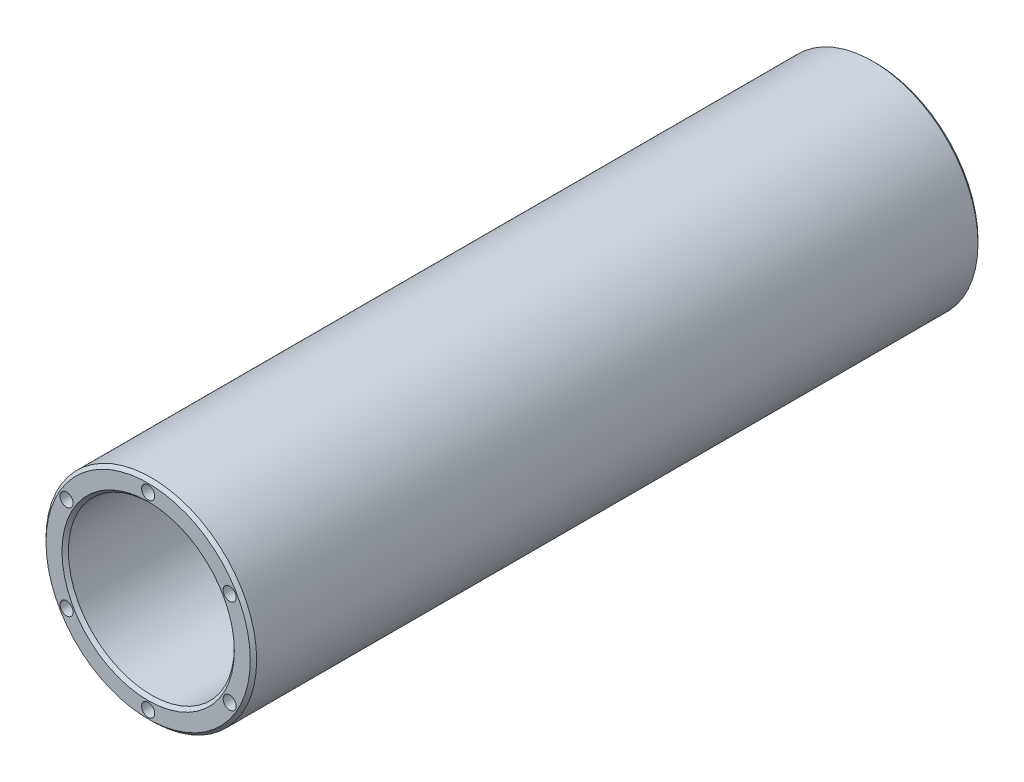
ISO-10303-21;
HEADER;
FILE_DESCRIPTION(('STEP AP214'),'2;1');
FILE_NAME('part.step','',(''),(''),'','','');
FILE_SCHEMA(('AUTOMOTIVE_DESIGN { 1 0 10303 214 1 1 1 1 }'));
ENDSEC;
DATA;
#1=APPLICATION_CONTEXT('core data for automotive mechanical design processes');
#2=APPLICATION_PROTOCOL_DEFINITION('international standard','automotive_design',2000,#1);
#3=PRODUCT_CONTEXT('',#1,'mechanical');
#4=PRODUCT('Part','Part','',(#3));
#5=PRODUCT_RELATED_PRODUCT_CATEGORY('part','',(#4));
#6=PRODUCT_DEFINITION_FORMATION('','',#4);
#7=PRODUCT_DEFINITION_CONTEXT('part definition',#1,'design');
#8=PRODUCT_DEFINITION('design','',#6,#7);
#9=PRODUCT_DEFINITION_SHAPE('','',#8);
#10=(LENGTH_UNIT() NAMED_UNIT(*) SI_UNIT(.MILLI.,.METRE.));
#11=(NAMED_UNIT(*) PLANE_ANGLE_UNIT() SI_UNIT($,.RADIAN.));
#12=(NAMED_UNIT(*) SI_UNIT($,.STERADIAN.) SOLID_ANGLE_UNIT());
#13=UNCERTAINTY_MEASURE_WITH_UNIT(LENGTH_MEASURE(1.E-05),#10,'distance_accuracy_value','');
#14=(GEOMETRIC_REPRESENTATION_CONTEXT(3) GLOBAL_UNCERTAINTY_ASSIGNED_CONTEXT((#13)) GLOBAL_UNIT_ASSIGNED_CONTEXT((#10,
#11,#12)) REPRESENTATION_CONTEXT('',''));
#15=CARTESIAN_POINT('',(0.,0.,0.));
#16=DIRECTION('',(0.,0.,1.));
#17=DIRECTION('',(1.,0.,0.));
#18=AXIS2_PLACEMENT_3D('',#15,#16,#17);
#19=CARTESIAN_POINT('',(0.,0.,57.));
#20=DIRECTION('',(0.,0.,1.));
#21=DIRECTION('',(1.,0.,0.));
#22=AXIS2_PLACEMENT_3D('',#19,#20,#21);
#23=PLANE('',#22);
#24=CARTESIAN_POINT('',(0.,0.,57.));
#25=DIRECTION('',(0.,0.,1.));
#26=DIRECTION('',(1.,0.,0.));
#27=AXIS2_PLACEMENT_3D('',#24,#25,#26);
#28=CIRCLE('',#27,13.5000000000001);
#29=CARTESIAN_POINT('',(13.5000000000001,0.,57.));
#30=VERTEX_POINT('',#29);
#31=EDGE_CURVE('E217',#30,#30,#28,.F.);
#32=ORIENTED_EDGE('',*,*,#31,.T.);
#33=EDGE_LOOP('',(#32));
#34=FACE_BOUND('',#33,.T.);
#35=CARTESIAN_POINT('',(0.,0.,57.));
#36=DIRECTION('',(0.,0.,1.));
#37=DIRECTION('',(1.,0.,0.));
#38=AXIS2_PLACEMENT_3D('',#35,#36,#37);
#39=CIRCLE('',#38,16.0000000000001);
#40=CARTESIAN_POINT('',(16.0000000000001,0.,57.));
#41=VERTEX_POINT('',#40);
#42=EDGE_CURVE('E213',#41,#41,#39,.T.);
#43=ORIENTED_EDGE('',*,*,#42,.T.);
#44=EDGE_LOOP('',(#43));
#45=FACE_BOUND('',#44,.T.);
#46=CARTESIAN_POINT('',(12.7738747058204,7.37500000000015,57.));
#47=DIRECTION('',(0.,0.,1.));
#48=DIRECTION('',(1.,0.,0.));
#49=AXIS2_PLACEMENT_3D('',#46,#47,#48);
#50=CIRCLE('',#49,1.025);
#51=CARTESIAN_POINT('',(13.7988747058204,7.37500000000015,57.));
#52=VERTEX_POINT('',#51);
#53=EDGE_CURVE('E103',#52,#52,#50,.T.);
#54=ORIENTED_EDGE('',*,*,#53,.F.);
#55=EDGE_LOOP('',(#54));
#56=FACE_BOUND('',#55,.T.);
#57=CARTESIAN_POINT('',(12.7738747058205,-7.37499999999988,57.));
#58=DIRECTION('',(0.,0.,1.));
#59=DIRECTION('',(1.,0.,0.));
#60=AXIS2_PLACEMENT_3D('',#57,#58,#59);
#61=CIRCLE('',#60,1.025);
#62=CARTESIAN_POINT('',(13.7988747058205,-7.37499999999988,57.));
#63=VERTEX_POINT('',#62);
#64=EDGE_CURVE('E102',#63,#63,#61,.T.);
#65=ORIENTED_EDGE('',*,*,#64,.F.);
#66=EDGE_LOOP('',(#65));
#67=FACE_BOUND('',#66,.T.);
#68=CARTESIAN_POINT('',(0.,-14.75,57.));
#69=DIRECTION('',(0.,0.,1.));
#70=DIRECTION('',(1.,0.,0.));
#71=AXIS2_PLACEMENT_3D('',#68,#69,#70);
#72=CIRCLE('',#71,1.025);
#73=CARTESIAN_POINT('',(1.025,-14.75,57.));
#74=VERTEX_POINT('',#73);
#75=EDGE_CURVE('E117',#74,#74,#72,.T.);
#76=ORIENTED_EDGE('',*,*,#75,.F.);
#77=EDGE_LOOP('',(#76));
#78=FACE_BOUND('',#77,.T.);
#79=CARTESIAN_POINT('',(-12.7738747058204,-7.37500000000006,57.));
#80=DIRECTION('',(0.,0.,1.));
#81=DIRECTION('',(1.,0.,0.));
#82=AXIS2_PLACEMENT_3D('',#79,#80,#81);
#83=CIRCLE('',#82,1.025);
#84=CARTESIAN_POINT('',(-11.7488747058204,-7.37500000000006,57.));
#85=VERTEX_POINT('',#84);
#86=EDGE_CURVE('E125',#85,#85,#83,.T.);
#87=ORIENTED_EDGE('',*,*,#86,.F.);
#88=EDGE_LOOP('',(#87));
#89=FACE_BOUND('',#88,.T.);
#90=CARTESIAN_POINT('',(-12.7738747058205,7.37499999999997,57.));
#91=DIRECTION('',(0.,0.,1.));
#92=DIRECTION('',(1.,0.,0.));
#93=AXIS2_PLACEMENT_3D('',#90,#91,#92);
#94=CIRCLE('',#93,1.025);
#95=CARTESIAN_POINT('',(-11.7488747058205,7.37499999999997,57.));
#96=VERTEX_POINT('',#95);
#97=EDGE_CURVE('E133',#96,#96,#94,.T.);
#98=ORIENTED_EDGE('',*,*,#97,.F.);
#99=EDGE_LOOP('',(#98));
#100=FACE_BOUND('',#99,.T.);
#101=CARTESIAN_POINT('',(0.,14.75,57.));
#102=DIRECTION('',(0.,0.,1.));
#103=DIRECTION('',(1.,0.,0.));
#104=AXIS2_PLACEMENT_3D('',#101,#102,#103);
#105=CIRCLE('',#104,1.025);
#106=CARTESIAN_POINT('',(1.025,14.75,57.));
#107=VERTEX_POINT('',#106);
#108=EDGE_CURVE('E141',#107,#107,#105,.T.);
#109=ORIENTED_EDGE('',*,*,#108,.F.);
#110=EDGE_LOOP('',(#109));
#111=FACE_BOUND('',#110,.T.);
#112=ADVANCED_FACE('F44',(#34,#45,#56,#67,#78,#89,#100,#111),#23,.T.);
#113=CARTESIAN_POINT('',(0.,0.,-57.));
#114=DIRECTION('',(0.,0.,1.));
#115=DIRECTION('',(1.,0.,0.));
#116=AXIS2_PLACEMENT_3D('',#113,#114,#115);
#117=PLANE('',#116);
#118=CARTESIAN_POINT('',(0.,0.,-57.));
#119=DIRECTION('',(0.,0.,1.));
#120=DIRECTION('',(1.,0.,0.));
#121=AXIS2_PLACEMENT_3D('',#118,#119,#120);
#122=CIRCLE('',#121,13.5);
#123=CARTESIAN_POINT('',(13.5,0.,-57.));
#124=VERTEX_POINT('',#123);
#125=EDGE_CURVE('E201',#124,#124,#122,.T.);
#126=ORIENTED_EDGE('',*,*,#125,.T.);
#127=EDGE_LOOP('',(#126));
#128=FACE_BOUND('',#127,.T.);
#129=CARTESIAN_POINT('',(0.,0.,-57.));
#130=DIRECTION('',(0.,0.,1.));
#131=DIRECTION('',(1.,0.,0.));
#132=AXIS2_PLACEMENT_3D('',#129,#130,#131);
#133=CIRCLE('',#132,15.9999999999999);
#134=CARTESIAN_POINT('',(15.9999999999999,0.,-57.));
#135=VERTEX_POINT('',#134);
#136=EDGE_CURVE('E197',#135,#135,#133,.F.);
#137=ORIENTED_EDGE('',*,*,#136,.T.);
#138=EDGE_LOOP('',(#137));
#139=FACE_BOUND('',#138,.T.);
#140=CARTESIAN_POINT('',(12.7738747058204,7.37500000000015,-57.));
#141=DIRECTION('',(0.,0.,-1.));
#142=DIRECTION('',(-1.,0.,0.));
#143=AXIS2_PLACEMENT_3D('',#140,#141,#142);
#144=CIRCLE('',#143,1.025);
#145=CARTESIAN_POINT('',(11.7488747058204,7.37500000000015,-57.));
#146=VERTEX_POINT('',#145);
#147=EDGE_CURVE('E149',#146,#146,#144,.T.);
#148=ORIENTED_EDGE('',*,*,#147,.F.);
#149=EDGE_LOOP('',(#148));
#150=FACE_BOUND('',#149,.T.);
#151=CARTESIAN_POINT('',(12.7738747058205,-7.37499999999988,-57.));
#152=DIRECTION('',(0.,0.,-1.));
#153=DIRECTION('',(-1.,0.,0.));
#154=AXIS2_PLACEMENT_3D('',#151,#152,#153);
#155=CIRCLE('',#154,1.025);
#156=CARTESIAN_POINT('',(11.7488747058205,-7.37499999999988,-57.));
#157=VERTEX_POINT('',#156);
#158=EDGE_CURVE('E157',#157,#157,#155,.T.);
#159=ORIENTED_EDGE('',*,*,#158,.F.);
#160=EDGE_LOOP('',(#159));
#161=FACE_BOUND('',#160,.T.);
#162=CARTESIAN_POINT('',(0.,-14.75,-57.));
#163=DIRECTION('',(0.,0.,-1.));
#164=DIRECTION('',(-1.,0.,0.));
#165=AXIS2_PLACEMENT_3D('',#162,#163,#164);
#166=CIRCLE('',#165,1.025);
#167=CARTESIAN_POINT('',(-1.025,-14.75,-57.));
#168=VERTEX_POINT('',#167);
#169=EDGE_CURVE('E165',#168,#168,#166,.T.);
#170=ORIENTED_EDGE('',*,*,#169,.F.);
#171=EDGE_LOOP('',(#170));
#172=FACE_BOUND('',#171,.T.);
#173=CARTESIAN_POINT('',(-12.7738747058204,-7.37500000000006,-57.));
#174=DIRECTION('',(0.,0.,-1.));
#175=DIRECTION('',(-1.,0.,0.));
#176=AXIS2_PLACEMENT_3D('',#173,#174,#175);
#177=CIRCLE('',#176,1.025);
#178=CARTESIAN_POINT('',(-13.7988747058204,-7.37500000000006,-57.));
#179=VERTEX_POINT('',#178);
#180=EDGE_CURVE('E173',#179,#179,#177,.T.);
#181=ORIENTED_EDGE('',*,*,#180,.F.);
#182=EDGE_LOOP('',(#181));
#183=FACE_BOUND('',#182,.T.);
#184=CARTESIAN_POINT('',(-12.7738747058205,7.37499999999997,-57.));
#185=DIRECTION('',(0.,0.,-1.));
#186=DIRECTION('',(-1.,0.,0.));
#187=AXIS2_PLACEMENT_3D('',#184,#185,#186);
#188=CIRCLE('',#187,1.025);
#189=CARTESIAN_POINT('',(-13.7988747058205,7.37499999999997,-57.));
#190=VERTEX_POINT('',#189);
#191=EDGE_CURVE('E181',#190,#190,#188,.T.);
#192=ORIENTED_EDGE('',*,*,#191,.F.);
#193=EDGE_LOOP('',(#192));
#194=FACE_BOUND('',#193,.T.);
#195=CARTESIAN_POINT('',(0.,14.75,-57.));
#196=DIRECTION('',(0.,0.,-1.));
#197=DIRECTION('',(-1.,0.,0.));
#198=AXIS2_PLACEMENT_3D('',#195,#196,#197);
#199=CIRCLE('',#198,1.025);
#200=CARTESIAN_POINT('',(-1.025,14.75,-57.));
#201=VERTEX_POINT('',#200);
#202=EDGE_CURVE('E189',#201,#201,#199,.T.);
#203=ORIENTED_EDGE('',*,*,#202,.F.);
#204=EDGE_LOOP('',(#203));
#205=FACE_BOUND('',#204,.T.);
#206=ADVANCED_FACE('F234',(#128,#139,#150,#161,#172,#183,#194,#205),#117,.F.);
#207=CARTESIAN_POINT('',(0.,0.,57.));
#208=DIRECTION('',(0.,0.,-1.));
#209=DIRECTION('',(-1.,0.,0.));
#210=AXIS2_PLACEMENT_3D('',#207,#208,#209);
#211=CYLINDRICAL_SURFACE('',#210,16.5);
#212=CARTESIAN_POINT('',(0.,0.,-56.4999999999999));
#213=DIRECTION('',(0.,0.,1.));
#214=DIRECTION('',(1.,0.,0.));
#215=AXIS2_PLACEMENT_3D('',#212,#213,#214);
#216=CIRCLE('',#215,16.5);
#217=CARTESIAN_POINT('',(-16.5,0.,-56.4999999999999));
#218=VERTEX_POINT('',#217);
#219=EDGE_CURVE('E11',#218,#218,#216,.T.);
#220=CARTESIAN_POINT('',(0.,0.,56.5000000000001));
#221=DIRECTION('',(0.,0.,1.));
#222=DIRECTION('',(1.,0.,0.));
#223=AXIS2_PLACEMENT_3D('',#220,#221,#222);
#224=CIRCLE('',#223,16.5);
#225=CARTESIAN_POINT('',(-16.5,0.,56.5000000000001));
#226=VERTEX_POINT('',#225);
#227=EDGE_CURVE('E54',#226,#226,#224,.F.);
#228=CARTESIAN_POINT('',(-16.5,0.,-56.4999999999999));
#229=CARTESIAN_POINT('',(-16.5,0.,-55.3229166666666));
#230=CARTESIAN_POINT('',(-16.5,0.,-54.1458333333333));
#231=CARTESIAN_POINT('',(-16.5,0.,-51.7916666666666));
#232=CARTESIAN_POINT('',(-16.5,0.,-50.6145833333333));
#233=CARTESIAN_POINT('',(-16.5,0.,-48.2604166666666));
#234=CARTESIAN_POINT('',(-16.5,0.,-47.0833333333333));
#235=CARTESIAN_POINT('',(-16.5,0.,-44.7291666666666));
#236=CARTESIAN_POINT('',(-16.5,0.,-43.5520833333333));
#237=CARTESIAN_POINT('',(-16.5,0.,-41.1979166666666));
#238=CARTESIAN_POINT('',(-16.5,0.,-40.0208333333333));
#239=CARTESIAN_POINT('',(-16.5,0.,-37.6666666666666));
#240=CARTESIAN_POINT('',(-16.5,0.,-36.4895833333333));
#241=CARTESIAN_POINT('',(-16.5,0.,-34.1354166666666));
#242=CARTESIAN_POINT('',(-16.5,0.,-32.9583333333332));
#243=CARTESIAN_POINT('',(-16.5,0.,-30.6041666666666));
#244=CARTESIAN_POINT('',(-16.5,0.,-29.4270833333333));
#245=CARTESIAN_POINT('',(-16.5,0.,-27.0729166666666));
#246=CARTESIAN_POINT('',(-16.5,0.,-25.8958333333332));
#247=CARTESIAN_POINT('',(-16.5,0.,-23.5416666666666));
#248=CARTESIAN_POINT('',(-16.5,0.,-22.3645833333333));
#249=CARTESIAN_POINT('',(-16.5,0.,-20.0104166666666));
#250=CARTESIAN_POINT('',(-16.5,0.,-18.8333333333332));
#251=CARTESIAN_POINT('',(-16.5,0.,-16.4791666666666));
#252=CARTESIAN_POINT('',(-16.5,0.,-15.3020833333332));
#253=CARTESIAN_POINT('',(-16.5,0.,-12.9479166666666));
#254=CARTESIAN_POINT('',(-16.5,0.,-11.7708333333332));
#255=CARTESIAN_POINT('',(-16.5,0.,-9.41666666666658));
#256=CARTESIAN_POINT('',(-16.5,0.,-8.23958333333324));
#257=CARTESIAN_POINT('',(-16.5,0.,-5.88541666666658));
#258=CARTESIAN_POINT('',(-16.5,0.,-4.70833333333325));
#259=CARTESIAN_POINT('',(-16.5,0.,-2.35416666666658));
#260=CARTESIAN_POINT('',(-16.5,0.,-1.17708333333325));
#261=CARTESIAN_POINT('',(-16.5,0.,1.17708333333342));
#262=CARTESIAN_POINT('',(-16.5,0.,2.35416666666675));
#263=CARTESIAN_POINT('',(-16.5,0.,4.70833333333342));
#264=CARTESIAN_POINT('',(-16.5,0.,5.88541666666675));
#265=CARTESIAN_POINT('',(-16.5,0.,8.23958333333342));
#266=CARTESIAN_POINT('',(-16.5,0.,9.41666666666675));
#267=CARTESIAN_POINT('',(-16.5,0.,11.7708333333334));
#268=CARTESIAN_POINT('',(-16.5,0.,12.9479166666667));
#269=CARTESIAN_POINT('',(-16.5,0.,15.3020833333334));
#270=CARTESIAN_POINT('',(-16.5,0.,16.4791666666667));
#271=CARTESIAN_POINT('',(-16.5,0.,18.8333333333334));
#272=CARTESIAN_POINT('',(-16.5,0.,20.0104166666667));
#273=CARTESIAN_POINT('',(-16.5,0.,22.3645833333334));
#274=CARTESIAN_POINT('',(-16.5,0.,23.5416666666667));
#275=CARTESIAN_POINT('',(-16.5,0.,25.8958333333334));
#276=CARTESIAN_POINT('',(-16.5,0.,27.0729166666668));
#277=CARTESIAN_POINT('',(-16.5,0.,29.4270833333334));
#278=CARTESIAN_POINT('',(-16.5,0.,30.6041666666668));
#279=CARTESIAN_POINT('',(-16.5,0.,32.9583333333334));
#280=CARTESIAN_POINT('',(-16.5,0.,34.1354166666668));
#281=CARTESIAN_POINT('',(-16.5,0.,36.4895833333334));
#282=CARTESIAN_POINT('',(-16.5,0.,37.6666666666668));
#283=CARTESIAN_POINT('',(-16.5,0.,40.0208333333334));
#284=CARTESIAN_POINT('',(-16.5,0.,41.1979166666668));
#285=CARTESIAN_POINT('',(-16.5,0.,43.5520833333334));
#286=CARTESIAN_POINT('',(-16.5,0.,44.7291666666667));
#287=CARTESIAN_POINT('',(-16.5,0.,47.0833333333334));
#288=CARTESIAN_POINT('',(-16.5,0.,48.2604166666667));
#289=CARTESIAN_POINT('',(-16.5,0.,50.6145833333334));
#290=CARTESIAN_POINT('',(-16.5,0.,51.7916666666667));
#291=CARTESIAN_POINT('',(-16.5,0.,54.1458333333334));
#292=CARTESIAN_POINT('',(-16.5,0.,55.3229166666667));
#293=CARTESIAN_POINT('',(-16.5,0.,56.5000000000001));
#294=B_SPLINE_CURVE_WITH_KNOTS('',3,(#228,#229,#230,#231,#232,#233,#234,#235,#236,#237,#238,
#239,#240,#241,#242,#243,#244,#245,#246,#247,#248,#249,#250,#251,#252,#253,#254,#255,#256,#257,
#258,#259,#260,#261,#262,#263,#264,#265,#266,#267,#268,#269,#270,#271,#272,#273,#274,#275,#276,
#277,#278,#279,#280,#281,#282,#283,#284,#285,#286,#287,#288,#289,#290,#291,#292,#293),
.UNSPECIFIED.,.F.,.F.,(4,2,2,2,2,2,2,2,2,2,2,2,2,2,2,2,2,2,2,2,2,2,2,2,2,2,2,2,2,2,2,2,4),(0.,
3.53125,7.0625,10.59375,14.125,17.65625,21.1875,24.71875,28.25,31.78125,35.3125,38.84375,42.375,
45.90625,49.4375,52.96875,56.5,60.03125,63.5625,67.09375,70.625,74.15625,77.6875,81.21875,84.75,
88.28125,91.8125,95.34375,98.875,102.40625,105.9375,109.46875,113.),.UNSPECIFIED.);
#295=EDGE_CURVE('BSEAM225',#218,#226,#294,.T.);
#296=ORIENTED_EDGE('',*,*,#219,.T.);
#297=ORIENTED_EDGE('',*,*,#227,.T.);
#298=ORIENTED_EDGE('',*,*,#295,.T.);
#299=ORIENTED_EDGE('',*,*,#295,.F.);
#300=EDGE_LOOP('',(#296,#298,#297,#299));
#301=FACE_BOUND('',#300,.T.);
#302=ADVANCED_FACE('F225',(#301),#211,.T.);
#303=CARTESIAN_POINT('',(0.,0.,57.));
#304=DIRECTION('',(0.,0.,-1.));
#305=DIRECTION('',(-1.,0.,0.));
#306=AXIS2_PLACEMENT_3D('',#303,#304,#305);
#307=CYLINDRICAL_SURFACE('',#306,13.);
#308=CARTESIAN_POINT('',(0.,0.,-56.5));
#309=DIRECTION('',(0.,0.,1.));
#310=DIRECTION('',(1.,0.,0.));
#311=AXIS2_PLACEMENT_3D('',#308,#309,#310);
#312=CIRCLE('',#311,13.);
#313=CARTESIAN_POINT('',(-13.,0.,-56.5));
#314=VERTEX_POINT('',#313);
#315=EDGE_CURVE('E209',#314,#314,#312,.F.);
#316=CARTESIAN_POINT('',(0.,0.,56.4999999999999));
#317=DIRECTION('',(0.,0.,1.));
#318=DIRECTION('',(1.,0.,0.));
#319=AXIS2_PLACEMENT_3D('',#316,#317,#318);
#320=CIRCLE('',#319,13.);
#321=CARTESIAN_POINT('',(-13.,0.,56.4999999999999));
#322=VERTEX_POINT('',#321);
#323=EDGE_CURVE('E205',#322,#322,#320,.T.);
#324=CARTESIAN_POINT('',(-13.,0.,-56.5));
#325=CARTESIAN_POINT('',(-13.,0.,-55.3229166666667));
#326=CARTESIAN_POINT('',(-13.,0.,-54.1458333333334));
#327=CARTESIAN_POINT('',(-13.,0.,-51.7916666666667));
#328=CARTESIAN_POINT('',(-13.,0.,-50.6145833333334));
#329=CARTESIAN_POINT('',(-13.,0.,-48.2604166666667));
#330=CARTESIAN_POINT('',(-13.,0.,-47.0833333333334));
#331=CARTESIAN_POINT('',(-13.,0.,-44.7291666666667));
#332=CARTESIAN_POINT('',(-13.,0.,-43.5520833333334));
#333=CARTESIAN_POINT('',(-13.,0.,-41.1979166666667));
#334=CARTESIAN_POINT('',(-13.,0.,-40.0208333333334));
#335=CARTESIAN_POINT('',(-13.,0.,-37.6666666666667));
#336=CARTESIAN_POINT('',(-13.,0.,-36.4895833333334));
#337=CARTESIAN_POINT('',(-13.,0.,-34.1354166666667));
#338=CARTESIAN_POINT('',(-13.,0.,-32.9583333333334));
#339=CARTESIAN_POINT('',(-13.,0.,-30.6041666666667));
#340=CARTESIAN_POINT('',(-13.,0.,-29.4270833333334));
#341=CARTESIAN_POINT('',(-13.,0.,-27.0729166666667));
#342=CARTESIAN_POINT('',(-13.,0.,-25.8958333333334));
#343=CARTESIAN_POINT('',(-13.,0.,-23.5416666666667));
#344=CARTESIAN_POINT('',(-13.,0.,-22.3645833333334));
#345=CARTESIAN_POINT('',(-13.,0.,-20.0104166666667));
#346=CARTESIAN_POINT('',(-13.,0.,-18.8333333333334));
#347=CARTESIAN_POINT('',(-13.,0.,-16.4791666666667));
#348=CARTESIAN_POINT('',(-13.,0.,-15.3020833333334));
#349=CARTESIAN_POINT('',(-13.,0.,-12.9479166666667));
#350=CARTESIAN_POINT('',(-13.,0.,-11.7708333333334));
#351=CARTESIAN_POINT('',(-13.,0.,-9.41666666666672));
#352=CARTESIAN_POINT('',(-13.,0.,-8.23958333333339));
#353=CARTESIAN_POINT('',(-13.,0.,-5.88541666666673));
#354=CARTESIAN_POINT('',(-13.,0.,-4.7083333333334));
#355=CARTESIAN_POINT('',(-13.,0.,-2.35416666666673));
#356=CARTESIAN_POINT('',(-13.,0.,-1.1770833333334));
#357=CARTESIAN_POINT('',(-13.,0.,1.17708333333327));
#358=CARTESIAN_POINT('',(-13.,0.,2.3541666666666));
#359=CARTESIAN_POINT('',(-13.,0.,4.70833333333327));
#360=CARTESIAN_POINT('',(-13.,0.,5.8854166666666));
#361=CARTESIAN_POINT('',(-13.,0.,8.23958333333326));
#362=CARTESIAN_POINT('',(-13.,0.,9.4166666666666));
#363=CARTESIAN_POINT('',(-13.,0.,11.7708333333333));
#364=CARTESIAN_POINT('',(-13.,0.,12.9479166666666));
#365=CARTESIAN_POINT('',(-13.,0.,15.3020833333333));
#366=CARTESIAN_POINT('',(-13.,0.,16.4791666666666));
#367=CARTESIAN_POINT('',(-13.,0.,18.8333333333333));
#368=CARTESIAN_POINT('',(-13.,0.,20.0104166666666));
#369=CARTESIAN_POINT('',(-13.,0.,22.3645833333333));
#370=CARTESIAN_POINT('',(-13.,0.,23.5416666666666));
#371=CARTESIAN_POINT('',(-13.,0.,25.8958333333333));
#372=CARTESIAN_POINT('',(-13.,0.,27.0729166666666));
#373=CARTESIAN_POINT('',(-13.,0.,29.4270833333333));
#374=CARTESIAN_POINT('',(-13.,0.,30.6041666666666));
#375=CARTESIAN_POINT('',(-13.,0.,32.9583333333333));
#376=CARTESIAN_POINT('',(-13.,0.,34.1354166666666));
#377=CARTESIAN_POINT('',(-13.,0.,36.4895833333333));
#378=CARTESIAN_POINT('',(-13.,0.,37.6666666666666));
#379=CARTESIAN_POINT('',(-13.,0.,40.0208333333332));
#380=CARTESIAN_POINT('',(-13.,0.,41.1979166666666));
#381=CARTESIAN_POINT('',(-13.,0.,43.5520833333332));
#382=CARTESIAN_POINT('',(-13.,0.,44.7291666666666));
#383=CARTESIAN_POINT('',(-13.,0.,47.0833333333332));
#384=CARTESIAN_POINT('',(-13.,0.,48.2604166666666));
#385=CARTESIAN_POINT('',(-13.,0.,50.6145833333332));
#386=CARTESIAN_POINT('',(-13.,0.,51.7916666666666));
#387=CARTESIAN_POINT('',(-13.,0.,54.1458333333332));
#388=CARTESIAN_POINT('',(-13.,0.,55.3229166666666));
#389=CARTESIAN_POINT('',(-13.,0.,56.4999999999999));
#390=B_SPLINE_CURVE_WITH_KNOTS('',3,(#324,#325,#326,#327,#328,#329,#330,#331,#332,#333,#334,
#335,#336,#337,#338,#339,#340,#341,#342,#343,#344,#345,#346,#347,#348,#349,#350,#351,#352,#353,
#354,#355,#356,#357,#358,#359,#360,#361,#362,#363,#364,#365,#366,#367,#368,#369,#370,#371,#372,
#373,#374,#375,#376,#377,#378,#379,#380,#381,#382,#383,#384,#385,#386,#387,#388,#389),
.UNSPECIFIED.,.F.,.F.,(4,2,2,2,2,2,2,2,2,2,2,2,2,2,2,2,2,2,2,2,2,2,2,2,2,2,2,2,2,2,2,2,4),(0.,
3.53125,7.0625,10.59375,14.125,17.65625,21.1875,24.71875,28.25,31.78125,35.3125,38.84375,42.375,
45.90625,49.4375,52.96875,56.5,60.03125,63.5625,67.09375,70.625,74.15625,77.6875,81.21875,84.75,
88.28125,91.8125,95.3437499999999,98.8749999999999,102.40625,105.9375,109.46875,113.),.UNSPECIFIED.);
#391=EDGE_CURVE('BSEAM313',#314,#322,#390,.T.);
#392=ORIENTED_EDGE('',*,*,#315,.T.);
#393=ORIENTED_EDGE('',*,*,#323,.T.);
#394=ORIENTED_EDGE('',*,*,#391,.T.);
#395=ORIENTED_EDGE('',*,*,#391,.F.);
#396=EDGE_LOOP('',(#392,#394,#393,#395));
#397=FACE_BOUND('',#396,.T.);
#398=ADVANCED_FACE('F313',(#397),#307,.F.);
#399=CARTESIAN_POINT('',(0.,14.75,-45.));
#400=DIRECTION('',(0.,0.,-1.));
#401=DIRECTION('',(-1.,0.,0.));
#402=AXIS2_PLACEMENT_3D('',#399,#400,#401);
#403=CONICAL_SURFACE('',#402,1.025,1.02974425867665);
#404=CARTESIAN_POINT('',(0.,14.75,-44.3841178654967));
#405=VERTEX_POINT('',#404);
#406=VERTEX_LOOP('',#405);
#407=FACE_BOUND('',#406,.T.);
#408=CARTESIAN_POINT('',(0.,14.75,-45.));
#409=DIRECTION('',(0.,0.,-1.));
#410=DIRECTION('',(-1.,0.,0.));
#411=AXIS2_PLACEMENT_3D('',#408,#409,#410);
#412=CIRCLE('',#411,1.025);
#413=CARTESIAN_POINT('',(-1.025,14.75,-45.));
#414=VERTEX_POINT('',#413);
#415=EDGE_CURVE('E193',#414,#414,#412,.T.);
#416=ORIENTED_EDGE('',*,*,#415,.T.);
#417=EDGE_LOOP('',(#416));
#418=FACE_BOUND('',#417,.T.);
#419=ADVANCED_FACE('F309',(#407,#418),#403,.F.);
#420=CARTESIAN_POINT('',(0.,14.75,-57.));
#421=DIRECTION('',(0.,0.,-1.));
#422=DIRECTION('',(-1.,0.,0.));
#423=AXIS2_PLACEMENT_3D('',#420,#421,#422);
#424=CYLINDRICAL_SURFACE('',#423,1.025);
#425=ORIENTED_EDGE('',*,*,#415,.F.);
#426=EDGE_LOOP('',(#425));
#427=FACE_BOUND('',#426,.T.);
#428=ORIENTED_EDGE('',*,*,#202,.T.);
#429=EDGE_LOOP('',(#428));
#430=FACE_BOUND('',#429,.T.);
#431=ADVANCED_FACE('F306',(#427,#430),#424,.F.);
#432=CARTESIAN_POINT('',(-12.7738747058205,7.37499999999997,-45.));
#433=DIRECTION('',(0.,0.,-1.));
#434=DIRECTION('',(-1.,0.,0.));
#435=AXIS2_PLACEMENT_3D('',#432,#433,#434);
#436=CONICAL_SURFACE('',#435,1.025,1.02974425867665);
#437=CARTESIAN_POINT('',(-12.7738747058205,7.37499999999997,-44.3841178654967));
#438=VERTEX_POINT('',#437);
#439=VERTEX_LOOP('',#438);
#440=FACE_BOUND('',#439,.T.);
#441=CARTESIAN_POINT('',(-12.7738747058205,7.37499999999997,-45.));
#442=DIRECTION('',(0.,0.,-1.));
#443=DIRECTION('',(-1.,0.,0.));
#444=AXIS2_PLACEMENT_3D('',#441,#442,#443);
#445=CIRCLE('',#444,1.025);
#446=CARTESIAN_POINT('',(-13.7988747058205,7.37499999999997,-45.));
#447=VERTEX_POINT('',#446);
#448=EDGE_CURVE('E185',#447,#447,#445,.T.);
#449=ORIENTED_EDGE('',*,*,#448,.T.);
#450=EDGE_LOOP('',(#449));
#451=FACE_BOUND('',#450,.T.);
#452=ADVANCED_FACE('F302',(#440,#451),#436,.F.);
#453=CARTESIAN_POINT('',(-12.7738747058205,7.37499999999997,-57.));
#454=DIRECTION('',(0.,0.,-1.));
#455=DIRECTION('',(-1.,0.,0.));
#456=AXIS2_PLACEMENT_3D('',#453,#454,#455);
#457=CYLINDRICAL_SURFACE('',#456,1.025);
#458=ORIENTED_EDGE('',*,*,#448,.F.);
#459=EDGE_LOOP('',(#458));
#460=FACE_BOUND('',#459,.T.);
#461=ORIENTED_EDGE('',*,*,#191,.T.);
#462=EDGE_LOOP('',(#461));
#463=FACE_BOUND('',#462,.T.);
#464=ADVANCED_FACE('F298',(#460,#463),#457,.F.);
#465=CARTESIAN_POINT('',(-12.7738747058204,-7.37500000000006,-45.));
#466=DIRECTION('',(0.,0.,-1.));
#467=DIRECTION('',(-1.,0.,0.));
#468=AXIS2_PLACEMENT_3D('',#465,#466,#467);
#469=CONICAL_SURFACE('',#468,1.025,1.02974425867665);
#470=CARTESIAN_POINT('',(-12.7738747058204,-7.37500000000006,-44.3841178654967));
#471=VERTEX_POINT('',#470);
#472=VERTEX_LOOP('',#471);
#473=FACE_BOUND('',#472,.T.);
#474=CARTESIAN_POINT('',(-12.7738747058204,-7.37500000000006,-45.));
#475=DIRECTION('',(0.,0.,-1.));
#476=DIRECTION('',(-1.,0.,0.));
#477=AXIS2_PLACEMENT_3D('',#474,#475,#476);
#478=CIRCLE('',#477,1.025);
#479=CARTESIAN_POINT('',(-13.7988747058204,-7.37500000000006,-45.));
#480=VERTEX_POINT('',#479);
#481=EDGE_CURVE('E177',#480,#480,#478,.T.);
#482=ORIENTED_EDGE('',*,*,#481,.T.);
#483=EDGE_LOOP('',(#482));
#484=FACE_BOUND('',#483,.T.);
#485=ADVANCED_FACE('F294',(#473,#484),#469,.F.);
#486=CARTESIAN_POINT('',(-12.7738747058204,-7.37500000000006,-57.));
#487=DIRECTION('',(0.,0.,-1.));
#488=DIRECTION('',(-1.,0.,0.));
#489=AXIS2_PLACEMENT_3D('',#486,#487,#488);
#490=CYLINDRICAL_SURFACE('',#489,1.025);
#491=ORIENTED_EDGE('',*,*,#481,.F.);
#492=EDGE_LOOP('',(#491));
#493=FACE_BOUND('',#492,.T.);
#494=ORIENTED_EDGE('',*,*,#180,.T.);
#495=EDGE_LOOP('',(#494));
#496=FACE_BOUND('',#495,.T.);
#497=ADVANCED_FACE('F290',(#493,#496),#490,.F.);
#498=CARTESIAN_POINT('',(0.,-14.75,-45.));
#499=DIRECTION('',(0.,0.,-1.));
#500=DIRECTION('',(-1.,0.,0.));
#501=AXIS2_PLACEMENT_3D('',#498,#499,#500);
#502=CONICAL_SURFACE('',#501,1.025,1.02974425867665);
#503=CARTESIAN_POINT('',(0.,-14.75,-44.3841178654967));
#504=VERTEX_POINT('',#503);
#505=VERTEX_LOOP('',#504);
#506=FACE_BOUND('',#505,.T.);
#507=CARTESIAN_POINT('',(0.,-14.75,-45.));
#508=DIRECTION('',(0.,0.,-1.));
#509=DIRECTION('',(-1.,0.,0.));
#510=AXIS2_PLACEMENT_3D('',#507,#508,#509);
#511=CIRCLE('',#510,1.025);
#512=CARTESIAN_POINT('',(-1.025,-14.75,-45.));
#513=VERTEX_POINT('',#512);
#514=EDGE_CURVE('E169',#513,#513,#511,.T.);
#515=ORIENTED_EDGE('',*,*,#514,.T.);
#516=EDGE_LOOP('',(#515));
#517=FACE_BOUND('',#516,.T.);
#518=ADVANCED_FACE('F286',(#506,#517),#502,.F.);
#519=CARTESIAN_POINT('',(0.,-14.75,-57.));
#520=DIRECTION('',(0.,0.,-1.));
#521=DIRECTION('',(-1.,0.,0.));
#522=AXIS2_PLACEMENT_3D('',#519,#520,#521);
#523=CYLINDRICAL_SURFACE('',#522,1.025);
#524=ORIENTED_EDGE('',*,*,#514,.F.);
#525=EDGE_LOOP('',(#524));
#526=FACE_BOUND('',#525,.T.);
#527=ORIENTED_EDGE('',*,*,#169,.T.);
#528=EDGE_LOOP('',(#527));
#529=FACE_BOUND('',#528,.T.);
#530=ADVANCED_FACE('F282',(#526,#529),#523,.F.);
#531=CARTESIAN_POINT('',(12.7738747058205,-7.37499999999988,-45.));
#532=DIRECTION('',(0.,0.,-1.));
#533=DIRECTION('',(-1.,0.,0.));
#534=AXIS2_PLACEMENT_3D('',#531,#532,#533);
#535=CONICAL_SURFACE('',#534,1.025,1.02974425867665);
#536=CARTESIAN_POINT('',(12.7738747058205,-7.37499999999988,-44.3841178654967));
#537=VERTEX_POINT('',#536);
#538=VERTEX_LOOP('',#537);
#539=FACE_BOUND('',#538,.T.);
#540=CARTESIAN_POINT('',(12.7738747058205,-7.37499999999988,-45.));
#541=DIRECTION('',(0.,0.,-1.));
#542=DIRECTION('',(-1.,0.,0.));
#543=AXIS2_PLACEMENT_3D('',#540,#541,#542);
#544=CIRCLE('',#543,1.025);
#545=CARTESIAN_POINT('',(11.7488747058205,-7.37499999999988,-45.));
#546=VERTEX_POINT('',#545);
#547=EDGE_CURVE('E161',#546,#546,#544,.T.);
#548=ORIENTED_EDGE('',*,*,#547,.T.);
#549=EDGE_LOOP('',(#548));
#550=FACE_BOUND('',#549,.T.);
#551=ADVANCED_FACE('F278',(#539,#550),#535,.F.);
#552=CARTESIAN_POINT('',(12.7738747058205,-7.37499999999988,-57.));
#553=DIRECTION('',(0.,0.,-1.));
#554=DIRECTION('',(-1.,0.,0.));
#555=AXIS2_PLACEMENT_3D('',#552,#553,#554);
#556=CYLINDRICAL_SURFACE('',#555,1.025);
#557=ORIENTED_EDGE('',*,*,#547,.F.);
#558=EDGE_LOOP('',(#557));
#559=FACE_BOUND('',#558,.T.);
#560=ORIENTED_EDGE('',*,*,#158,.T.);
#561=EDGE_LOOP('',(#560));
#562=FACE_BOUND('',#561,.T.);
#563=ADVANCED_FACE('F274',(#559,#562),#556,.F.);
#564=CARTESIAN_POINT('',(12.7738747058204,7.37500000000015,-45.));
#565=DIRECTION('',(0.,0.,-1.));
#566=DIRECTION('',(-1.,0.,0.));
#567=AXIS2_PLACEMENT_3D('',#564,#565,#566);
#568=CONICAL_SURFACE('',#567,1.025,1.02974425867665);
#569=CARTESIAN_POINT('',(12.7738747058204,7.37500000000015,-44.3841178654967));
#570=VERTEX_POINT('',#569);
#571=VERTEX_LOOP('',#570);
#572=FACE_BOUND('',#571,.T.);
#573=CARTESIAN_POINT('',(12.7738747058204,7.37500000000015,-45.));
#574=DIRECTION('',(0.,0.,-1.));
#575=DIRECTION('',(-1.,0.,0.));
#576=AXIS2_PLACEMENT_3D('',#573,#574,#575);
#577=CIRCLE('',#576,1.025);
#578=CARTESIAN_POINT('',(11.7488747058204,7.37500000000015,-45.));
#579=VERTEX_POINT('',#578);
#580=EDGE_CURVE('E153',#579,#579,#577,.T.);
#581=ORIENTED_EDGE('',*,*,#580,.T.);
#582=EDGE_LOOP('',(#581));
#583=FACE_BOUND('',#582,.T.);
#584=ADVANCED_FACE('F270',(#572,#583),#568,.F.);
#585=CARTESIAN_POINT('',(12.7738747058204,7.37500000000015,-57.));
#586=DIRECTION('',(0.,0.,-1.));
#587=DIRECTION('',(-1.,0.,0.));
#588=AXIS2_PLACEMENT_3D('',#585,#586,#587);
#589=CYLINDRICAL_SURFACE('',#588,1.025);
#590=ORIENTED_EDGE('',*,*,#580,.F.);
#591=EDGE_LOOP('',(#590));
#592=FACE_BOUND('',#591,.T.);
#593=ORIENTED_EDGE('',*,*,#147,.T.);
#594=EDGE_LOOP('',(#593));
#595=FACE_BOUND('',#594,.T.);
#596=ADVANCED_FACE('F262',(#592,#595),#589,.F.);
#597=CARTESIAN_POINT('',(0.,14.75,45.));
#598=DIRECTION('',(0.,0.,1.));
#599=DIRECTION('',(1.,0.,0.));
#600=AXIS2_PLACEMENT_3D('',#597,#598,#599);
#601=CONICAL_SURFACE('',#600,1.025,1.02974425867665);
#602=CARTESIAN_POINT('',(0.,14.75,44.3841178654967));
#603=VERTEX_POINT('',#602);
#604=VERTEX_LOOP('',#603);
#605=FACE_BOUND('',#604,.T.);
#606=CARTESIAN_POINT('',(0.,14.75,45.));
#607=DIRECTION('',(0.,0.,1.));
#608=DIRECTION('',(1.,0.,0.));
#609=AXIS2_PLACEMENT_3D('',#606,#607,#608);
#610=CIRCLE('',#609,1.025);
#611=CARTESIAN_POINT('',(1.025,14.75,45.));
#612=VERTEX_POINT('',#611);
#613=EDGE_CURVE('E145',#612,#612,#610,.T.);
#614=ORIENTED_EDGE('',*,*,#613,.T.);
#615=EDGE_LOOP('',(#614));
#616=FACE_BOUND('',#615,.T.);
#617=ADVANCED_FACE('F252',(#605,#616),#601,.F.);
#618=CARTESIAN_POINT('',(0.,14.75,57.));
#619=DIRECTION('',(0.,0.,1.));
#620=DIRECTION('',(1.,0.,0.));
#621=AXIS2_PLACEMENT_3D('',#618,#619,#620);
#622=CYLINDRICAL_SURFACE('',#621,1.025);
#623=ORIENTED_EDGE('',*,*,#613,.F.);
#624=EDGE_LOOP('',(#623));
#625=FACE_BOUND('',#624,.T.);
#626=ORIENTED_EDGE('',*,*,#108,.T.);
#627=EDGE_LOOP('',(#626));
#628=FACE_BOUND('',#627,.T.);
#629=ADVANCED_FACE('F249',(#625,#628),#622,.F.);
#630=CARTESIAN_POINT('',(-12.7738747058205,7.37499999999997,45.));
#631=DIRECTION('',(0.,0.,1.));
#632=DIRECTION('',(1.,0.,0.));
#633=AXIS2_PLACEMENT_3D('',#630,#631,#632);
#634=CONICAL_SURFACE('',#633,1.025,1.02974425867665);
#635=CARTESIAN_POINT('',(-12.7738747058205,7.37499999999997,44.3841178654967));
#636=VERTEX_POINT('',#635);
#637=VERTEX_LOOP('',#636);
#638=FACE_BOUND('',#637,.T.);
#639=CARTESIAN_POINT('',(-12.7738747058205,7.37499999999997,45.));
#640=DIRECTION('',(0.,0.,1.));
#641=DIRECTION('',(1.,0.,0.));
#642=AXIS2_PLACEMENT_3D('',#639,#640,#641);
#643=CIRCLE('',#642,1.025);
#644=CARTESIAN_POINT('',(-11.7488747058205,7.37499999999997,45.));
#645=VERTEX_POINT('',#644);
#646=EDGE_CURVE('E137',#645,#645,#643,.T.);
#647=ORIENTED_EDGE('',*,*,#646,.T.);
#648=EDGE_LOOP('',(#647));
#649=FACE_BOUND('',#648,.T.);
#650=ADVANCED_FACE('F251',(#638,#649),#634,.F.);
#651=CARTESIAN_POINT('',(-12.7738747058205,7.37499999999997,57.));
#652=DIRECTION('',(0.,0.,1.));
#653=DIRECTION('',(1.,0.,0.));
#654=AXIS2_PLACEMENT_3D('',#651,#652,#653);
#655=CYLINDRICAL_SURFACE('',#654,1.025);
#656=ORIENTED_EDGE('',*,*,#646,.F.);
#657=EDGE_LOOP('',(#656));
#658=FACE_BOUND('',#657,.T.);
#659=ORIENTED_EDGE('',*,*,#97,.T.);
#660=EDGE_LOOP('',(#659));
#661=FACE_BOUND('',#660,.T.);
#662=ADVANCED_FACE('F259',(#658,#661),#655,.F.);
#663=CARTESIAN_POINT('',(-12.7738747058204,-7.37500000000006,45.));
#664=DIRECTION('',(0.,0.,1.));
#665=DIRECTION('',(1.,0.,0.));
#666=AXIS2_PLACEMENT_3D('',#663,#664,#665);
#667=CONICAL_SURFACE('',#666,1.025,1.02974425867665);
#668=CARTESIAN_POINT('',(-12.7738747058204,-7.37500000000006,44.3841178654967));
#669=VERTEX_POINT('',#668);
#670=VERTEX_LOOP('',#669);
#671=FACE_BOUND('',#670,.T.);
#672=CARTESIAN_POINT('',(-12.7738747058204,-7.37500000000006,45.));
#673=DIRECTION('',(0.,0.,1.));
#674=DIRECTION('',(1.,0.,0.));
#675=AXIS2_PLACEMENT_3D('',#672,#673,#674);
#676=CIRCLE('',#675,1.025);
#677=CARTESIAN_POINT('',(-11.7488747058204,-7.37500000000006,45.));
#678=VERTEX_POINT('',#677);
#679=EDGE_CURVE('E129',#678,#678,#676,.T.);
#680=ORIENTED_EDGE('',*,*,#679,.T.);
#681=EDGE_LOOP('',(#680));
#682=FACE_BOUND('',#681,.T.);
#683=ADVANCED_FACE('F502',(#671,#682),#667,.F.);
#684=CARTESIAN_POINT('',(-12.7738747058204,-7.37500000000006,57.));
#685=DIRECTION('',(0.,0.,1.));
#686=DIRECTION('',(1.,0.,0.));
#687=AXIS2_PLACEMENT_3D('',#684,#685,#686);
#688=CYLINDRICAL_SURFACE('',#687,1.025);
#689=ORIENTED_EDGE('',*,*,#679,.F.);
#690=EDGE_LOOP('',(#689));
#691=FACE_BOUND('',#690,.T.);
#692=ORIENTED_EDGE('',*,*,#86,.T.);
#693=EDGE_LOOP('',(#692));
#694=FACE_BOUND('',#693,.T.);
#695=ADVANCED_FACE('F491',(#691,#694),#688,.F.);
#696=CARTESIAN_POINT('',(0.,-14.75,45.));
#697=DIRECTION('',(0.,0.,1.));
#698=DIRECTION('',(1.,0.,0.));
#699=AXIS2_PLACEMENT_3D('',#696,#697,#698);
#700=CONICAL_SURFACE('',#699,1.025,1.02974425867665);
#701=CARTESIAN_POINT('',(0.,-14.75,44.3841178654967));
#702=VERTEX_POINT('',#701);
#703=VERTEX_LOOP('',#702);
#704=FACE_BOUND('',#703,.T.);
#705=CARTESIAN_POINT('',(0.,-14.75,45.));
#706=DIRECTION('',(0.,0.,1.));
#707=DIRECTION('',(1.,0.,0.));
#708=AXIS2_PLACEMENT_3D('',#705,#706,#707);
#709=CIRCLE('',#708,1.025);
#710=CARTESIAN_POINT('',(1.025,-14.75,45.));
#711=VERTEX_POINT('',#710);
#712=EDGE_CURVE('E121',#711,#711,#709,.T.);
#713=ORIENTED_EDGE('',*,*,#712,.T.);
#714=EDGE_LOOP('',(#713));
#715=FACE_BOUND('',#714,.T.);
#716=ADVANCED_FACE('F478',(#704,#715),#700,.F.);
#717=CARTESIAN_POINT('',(0.,-14.75,57.));
#718=DIRECTION('',(0.,0.,1.));
#719=DIRECTION('',(1.,0.,0.));
#720=AXIS2_PLACEMENT_3D('',#717,#718,#719);
#721=CYLINDRICAL_SURFACE('',#720,1.025);
#722=ORIENTED_EDGE('',*,*,#712,.F.);
#723=EDGE_LOOP('',(#722));
#724=FACE_BOUND('',#723,.T.);
#725=ORIENTED_EDGE('',*,*,#75,.T.);
#726=EDGE_LOOP('',(#725));
#727=FACE_BOUND('',#726,.T.);
#728=ADVANCED_FACE('F467',(#724,#727),#721,.F.);
#729=CARTESIAN_POINT('',(12.7738747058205,-7.37499999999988,45.));
#730=DIRECTION('',(0.,0.,1.));
#731=DIRECTION('',(1.,0.,0.));
#732=AXIS2_PLACEMENT_3D('',#729,#730,#731);
#733=CONICAL_SURFACE('',#732,1.025,1.02974425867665);
#734=CARTESIAN_POINT('',(12.7738747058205,-7.37499999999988,44.3841178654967));
#735=VERTEX_POINT('',#734);
#736=VERTEX_LOOP('',#735);
#737=FACE_BOUND('',#736,.T.);
#738=CARTESIAN_POINT('',(12.7738747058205,-7.37499999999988,45.));
#739=DIRECTION('',(0.,0.,1.));
#740=DIRECTION('',(1.,0.,0.));
#741=AXIS2_PLACEMENT_3D('',#738,#739,#740);
#742=CIRCLE('',#741,1.025);
#743=CARTESIAN_POINT('',(13.7988747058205,-7.37499999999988,45.));
#744=VERTEX_POINT('',#743);
#745=EDGE_CURVE('E109',#744,#744,#742,.T.);
#746=ORIENTED_EDGE('',*,*,#745,.T.);
#747=EDGE_LOOP('',(#746));
#748=FACE_BOUND('',#747,.T.);
#749=ADVANCED_FACE('F454',(#737,#748),#733,.F.);
#750=CARTESIAN_POINT('',(12.7738747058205,-7.37499999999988,57.));
#751=DIRECTION('',(0.,0.,1.));
#752=DIRECTION('',(1.,0.,0.));
#753=AXIS2_PLACEMENT_3D('',#750,#751,#752);
#754=CYLINDRICAL_SURFACE('',#753,1.025);
#755=ORIENTED_EDGE('',*,*,#745,.F.);
#756=EDGE_LOOP('',(#755));
#757=FACE_BOUND('',#756,.T.);
#758=ORIENTED_EDGE('',*,*,#64,.T.);
#759=EDGE_LOOP('',(#758));
#760=FACE_BOUND('',#759,.T.);
#761=ADVANCED_FACE('F95',(#757,#760),#754,.F.);
#762=CARTESIAN_POINT('',(12.7738747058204,7.37500000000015,45.));
#763=DIRECTION('',(0.,0.,1.));
#764=DIRECTION('',(1.,0.,0.));
#765=AXIS2_PLACEMENT_3D('',#762,#763,#764);
#766=CONICAL_SURFACE('',#765,1.025,1.02974425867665);
#767=CARTESIAN_POINT('',(12.7738747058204,7.37500000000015,44.3841178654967));
#768=VERTEX_POINT('',#767);
#769=VERTEX_LOOP('',#768);
#770=FACE_BOUND('',#769,.T.);
#771=CARTESIAN_POINT('',(12.7738747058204,7.37500000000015,45.));
#772=DIRECTION('',(0.,0.,1.));
#773=DIRECTION('',(1.,0.,0.));
#774=AXIS2_PLACEMENT_3D('',#771,#772,#773);
#775=CIRCLE('',#774,1.025);
#776=CARTESIAN_POINT('',(13.7988747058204,7.37500000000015,45.));
#777=VERTEX_POINT('',#776);
#778=EDGE_CURVE('E99',#777,#777,#775,.T.);
#779=ORIENTED_EDGE('',*,*,#778,.T.);
#780=EDGE_LOOP('',(#779));
#781=FACE_BOUND('',#780,.T.);
#782=ADVANCED_FACE('F91',(#770,#781),#766,.F.);
#783=CARTESIAN_POINT('',(12.7738747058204,7.37500000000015,57.));
#784=DIRECTION('',(0.,0.,1.));
#785=DIRECTION('',(1.,0.,0.));
#786=AXIS2_PLACEMENT_3D('',#783,#784,#785);
#787=CYLINDRICAL_SURFACE('',#786,1.025);
#788=ORIENTED_EDGE('',*,*,#778,.F.);
#789=EDGE_LOOP('',(#788));
#790=FACE_BOUND('',#789,.T.);
#791=ORIENTED_EDGE('',*,*,#53,.T.);
#792=EDGE_LOOP('',(#791));
#793=FACE_BOUND('',#792,.T.);
#794=ADVANCED_FACE('F94',(#790,#793),#787,.F.);
#795=CARTESIAN_POINT('',(0.,0.,-57.));
#796=DIRECTION('',(0.,0.,-1.));
#797=DIRECTION('',(-1.,0.,0.));
#798=AXIS2_PLACEMENT_3D('',#795,#796,#797);
#799=CONICAL_SURFACE('',#798,13.5,0.785398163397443);
#800=ORIENTED_EDGE('',*,*,#315,.F.);
#801=EDGE_LOOP('',(#800));
#802=FACE_BOUND('',#801,.T.);
#803=ORIENTED_EDGE('',*,*,#125,.F.);
#804=EDGE_LOOP('',(#803));
#805=FACE_BOUND('',#804,.T.);
#806=ADVANCED_FACE('F324',(#802,#805),#799,.F.);
#807=CARTESIAN_POINT('',(0.,0.,56.4999999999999));
#808=DIRECTION('',(0.,0.,1.));
#809=DIRECTION('',(1.,0.,0.));
#810=AXIS2_PLACEMENT_3D('',#807,#808,#809);
#811=CONICAL_SURFACE('',#810,13.,0.78539816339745);
#812=ORIENTED_EDGE('',*,*,#31,.F.);
#813=EDGE_LOOP('',(#812));
#814=FACE_BOUND('',#813,.T.);
#815=ORIENTED_EDGE('',*,*,#323,.F.);
#816=EDGE_LOOP('',(#815));
#817=FACE_BOUND('',#816,.T.);
#818=ADVANCED_FACE('F330',(#814,#817),#811,.F.);
#819=CARTESIAN_POINT('',(0.,0.,-56.4999999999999));
#820=DIRECTION('',(0.,0.,1.));
#821=DIRECTION('',(1.,0.,0.));
#822=AXIS2_PLACEMENT_3D('',#819,#820,#821);
#823=CONICAL_SURFACE('',#822,16.5,0.785398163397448);
#824=ORIENTED_EDGE('',*,*,#136,.F.);
#825=EDGE_LOOP('',(#824));
#826=FACE_BOUND('',#825,.T.);
#827=ORIENTED_EDGE('',*,*,#219,.F.);
#828=EDGE_LOOP('',(#827));
#829=FACE_BOUND('',#828,.T.);
#830=ADVANCED_FACE('F229',(#826,#829),#823,.T.);
#831=CARTESIAN_POINT('',(0.,0.,57.));
#832=DIRECTION('',(0.,0.,-1.));
#833=DIRECTION('',(-1.,0.,0.));
#834=AXIS2_PLACEMENT_3D('',#831,#832,#833);
#835=CONICAL_SURFACE('',#834,16.0000000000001,0.785398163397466);
#836=ORIENTED_EDGE('',*,*,#227,.F.);
#837=EDGE_LOOP('',(#836));
#838=FACE_BOUND('',#837,.T.);
#839=ORIENTED_EDGE('',*,*,#42,.F.);
#840=EDGE_LOOP('',(#839));
#841=FACE_BOUND('',#840,.T.);
#842=ADVANCED_FACE('F47',(#838,#841),#835,.T.);
#843=CLOSED_SHELL('',(#112,#206,#302,#398,#419,#431,#452,#464,#485,#497,#518,#530,#551,#563,
#584,#596,#617,#629,#650,#662,#683,#695,#716,#728,#749,#761,#782,#794,#806,#818,#830,#842));
#844=MANIFOLD_SOLID_BREP('B2',#843);
#845=ADVANCED_BREP_SHAPE_REPRESENTATION('',(#18,#844),#14);
#846=SHAPE_DEFINITION_REPRESENTATION(#9,#845);
ENDSEC;
END-ISO-10303-21;
